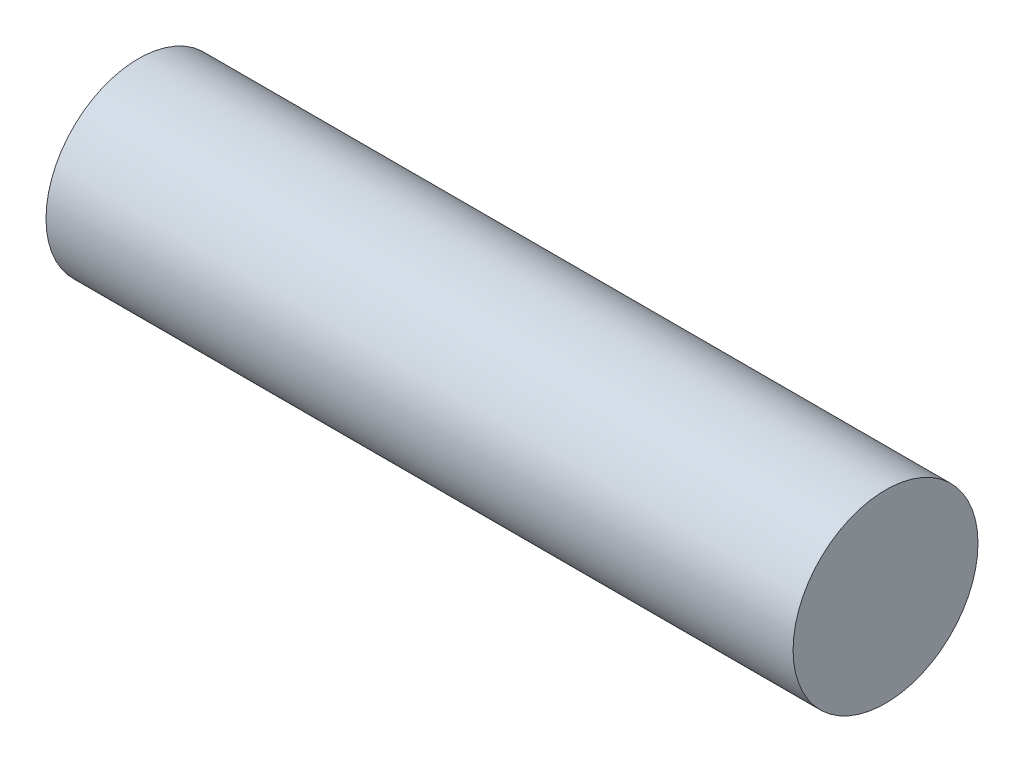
from build123d import *

# Parameters (mm, degrees)
BOSS_EXTRUDE1_DEPTH      = 25.4
BOSS_EXTRUDE1_DEPTH_BACK = 0.254
SKETCH2_R                = 3.175


with BuildPart() as part:
    # Sketch2 → Boss-Extrude1 (new, two sides: drawn at the far end of the back side and taken through both)
    with BuildSketch(Plane.YZ.offset(-BOSS_EXTRUDE1_DEPTH_BACK)):
        with Locations(Location((0, 0, 0), (0, 0, 270))):
            Circle(SKETCH2_R)
    extrude(amount=BOSS_EXTRUDE1_DEPTH + BOSS_EXTRUDE1_DEPTH_BACK)


solid = part.part
